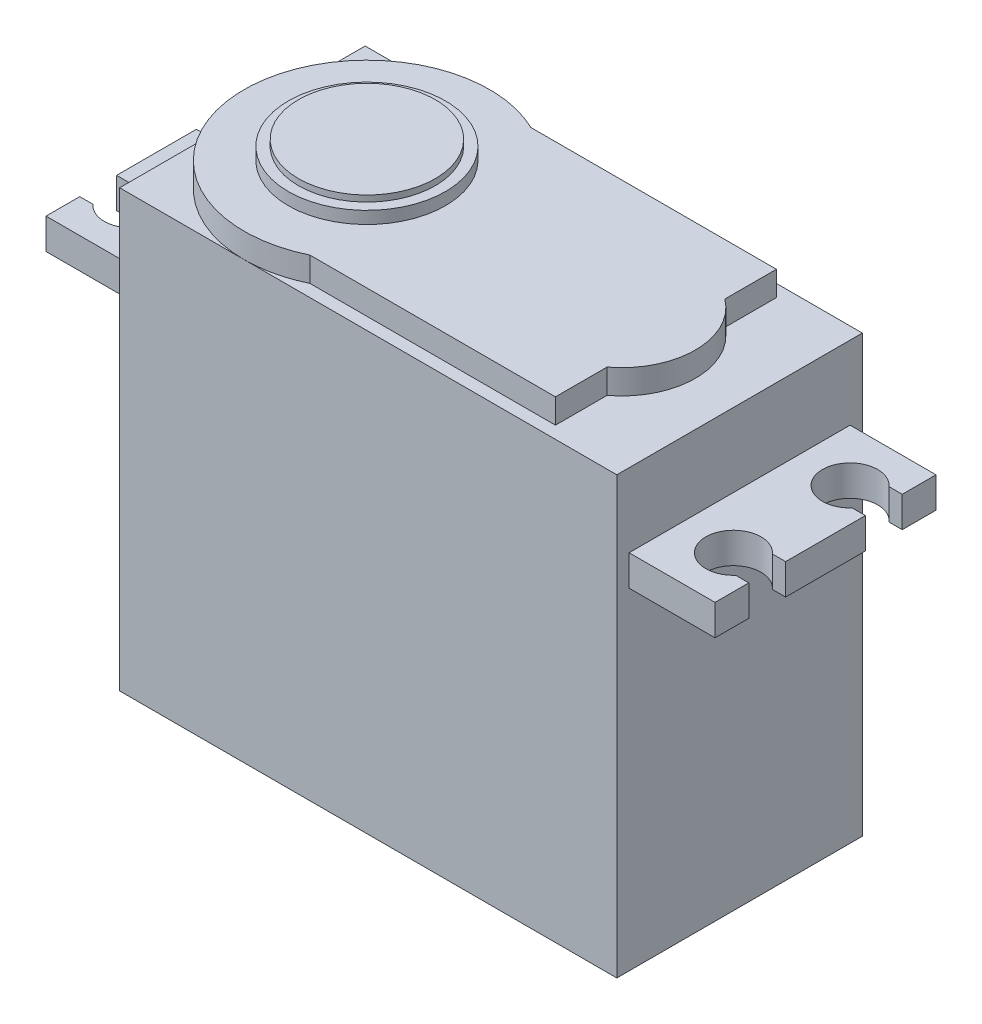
from build123d import *

# Parameters (mm, degrees)
SKETCH1_W            = 40.5
SKETCH1_H            = 20
BOSS_EXTRUDE1_DEPTH  = 35.5
BOSS_EXTRUDE2_DEPTH  = 2
SKETCH3_R            = 6.4
BOSS_EXTRUDE3_DEPTH  = 1
SKETCH4_R            = 5.575
BOSS_EXTRUDE4_DEPTH  = 0.5
BOSS_EXTRUDE5_DEPTH  = 2.5
MIRROR2_COPY_1_DEPTH = 2.5


with BuildPart() as part:
    # Sketch1 → Boss-Extrude1 (new body)
    with BuildSketch(Plane(origin=(0, 0, 0), x_dir=(1, 0, 0), z_dir=(0, 1, 0))):
        Rectangle(SKETCH1_W, SKETCH1_H)
    extrude(amount=BOSS_EXTRUDE1_DEPTH)

    # Sketch2 → Boss-Extrude2 (add)
    with BuildSketch(Plane(origin=(0, 35.5, 0), x_dir=(1, 0, 0), z_dir=(0, 1, 0))):
        with BuildLine():
            Line((-5.75, -9), (14.25, -9))
            Line((14.25, -9), (14.25, -4.8))
            ThreePointArc((14.25, -4.8), (16.65, 0), (14.25, 4.8))
            Line((14.25, 4.8), (14.25, 9))
            Line((14.25, 9), (-5.75, 9))
            ThreePointArc((-5.75, 9), (-20.108898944, 0), (-5.75, -9))
        make_face()
    extrude(amount=BOSS_EXTRUDE2_DEPTH)

    # Sketch3 → Boss-Extrude3 (add)
    with BuildSketch(Plane(origin=(0, 37.5, 0), x_dir=(1, 0, 0), z_dir=(0, 1, 0))):
        with Locations(Location((-10.108898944, 0, 0), (0, 0, 270))):
            Circle(SKETCH3_R)
    extrude(amount=BOSS_EXTRUDE3_DEPTH)

    # Sketch4 → Boss-Extrude4 (add)
    with BuildSketch(Plane(origin=(0, 38.5, 0), x_dir=(1, 0, 0), z_dir=(0, 1, 0))):
        with Locations(Location((-10.108898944, 0, 0), (0, 0, 270))):
            Circle(SKETCH4_R)
    extrude(amount=BOSS_EXTRUDE4_DEPTH)

    # Sketch5 → Boss-Extrude5 (add)
    with BuildSketch(Plane(origin=(0, 29.5, 0), x_dir=(1, 0, 0), z_dir=(0, 1, 0))):
        with BuildLine():
            Line((20.25, 9), (27.25, 9))
            Line((27.25, 9), (27.25, 6.25))
            Line((27.25, 6.25), (26.177050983, 6.25))
            ThreePointArc((26.177050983, 6.25), (22.25, 4.75), (26.177050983, 3.25))
            Line((26.177050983, 3.25), (27.25, 3.25))
            Line((27.25, 3.25), (27.25, 0))
            Line((27.25, 0), (20.25, 0))
            Line((20.25, 0), (20.25, 9))
        make_face()
    boss_extrude5 = extrude(amount=-BOSS_EXTRUDE5_DEPTH)

    # Mirror1: Boss-Extrude5 across plane
    add(boss_extrude5.mirror(Plane(origin=(0, 0, 0), x_dir=(0, 0, 1), z_dir=(1, 0, 0))))

    # Mirror2: Boss-Extrude5 across plane
    add(boss_extrude5.mirror(Plane.XY))

    # Mirror2 copy 1 sketch → Mirror2 copy 1 (add)
    with BuildSketch(Plane(origin=(0, 29.5, 0), x_dir=(-1, 0, 0), z_dir=(0, 1, 0))):
        with BuildLine():
            Line((20.25, 9), (27.25, 9))
            Line((27.25, 9), (27.25, 6.25))
            Line((27.25, 6.25), (26.177050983, 6.25))
            ThreePointArc((26.177050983, 6.25), (22.25, 4.75), (26.177050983, 3.25))
            Line((26.177050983, 3.25), (27.25, 3.25))
            Line((27.25, 3.25), (27.25, 0))
            Line((27.25, 0), (20.25, 0))
            Line((20.25, 0), (20.25, 9))
        make_face()
    extrude(amount=-MIRROR2_COPY_1_DEPTH)


solid = part.part
